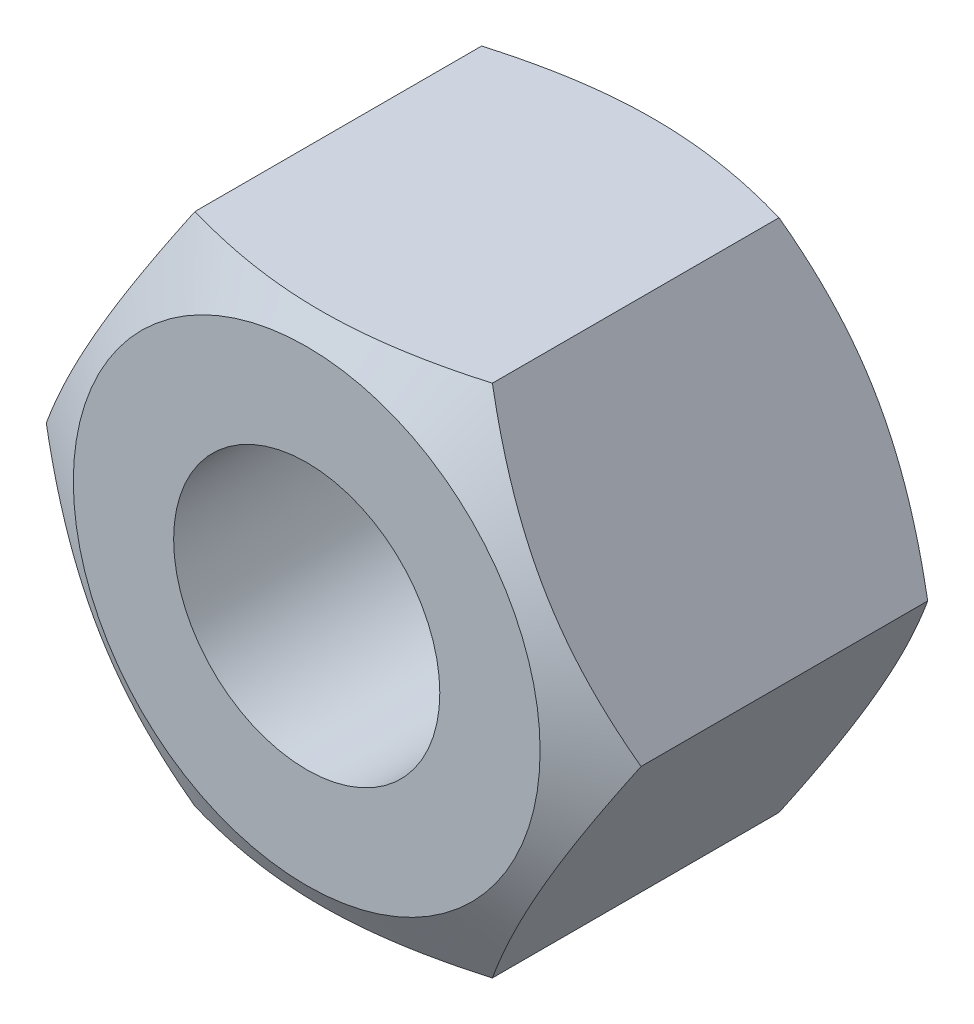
from build123d import *

# Parameters (mm, degrees)
SKETCH1_R     = 2.067
BASENUT_DEPTH = 5.6


with BuildPart() as part:
    # Sketch1 → BaseNut (new body)
    with BuildSketch(Plane.XY):
        Polygon((2.309401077, -4), (4.618802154, 0), (2.309401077, 4), (-2.309401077, 4), (-4.618802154, 0), (-2.309401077, -4), align=None)
        Circle(SKETCH1_R, mode=Mode.SUBTRACT)
    extrude(amount=-BASENUT_DEPTH)

    # Sketch2 → Double-Chamfer (revolve, cut)
    with BuildSketch(Plane(origin=(0, 0, 0), x_dir=(1, 0, 0), z_dir=(0, 1, 0))):
        Polygon((-4.618802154, 5.6), (-3.625, 5.6), (-4.618802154, 5.026228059), align=None)
        Polygon((-4.618802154, 0.573771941), (-4.618802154, 0), (-3.625, 0), align=None)
    revolve(axis=Axis((0, 0, -3.375940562), (0, 0, 1)), mode=Mode.SUBTRACT)


solid = part.part
